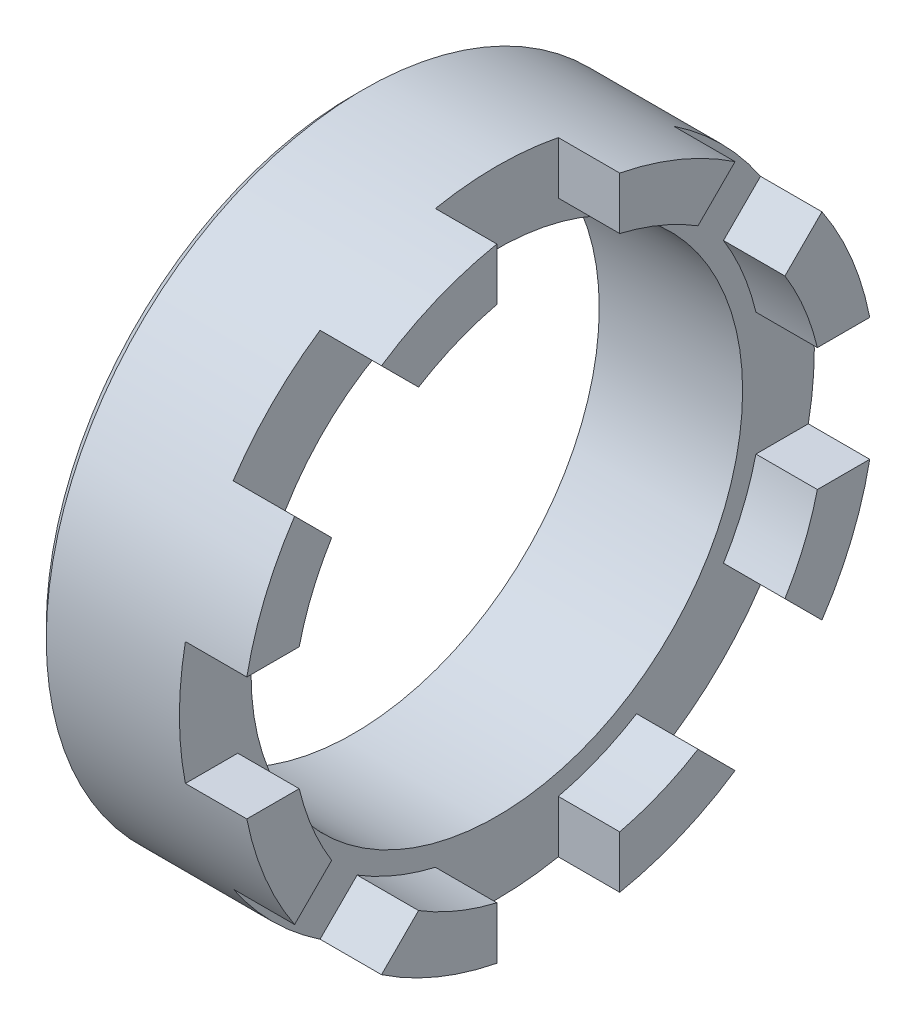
ISO-10303-21;
HEADER;
FILE_DESCRIPTION(('STEP AP214'),'2;1');
FILE_NAME('part.step','',(''),(''),'','','');
FILE_SCHEMA(('AUTOMOTIVE_DESIGN { 1 0 10303 214 1 1 1 1 }'));
ENDSEC;
DATA;
#1=APPLICATION_CONTEXT('core data for automotive mechanical design processes');
#2=APPLICATION_PROTOCOL_DEFINITION('international standard','automotive_design',2000,#1);
#3=PRODUCT_CONTEXT('',#1,'mechanical');
#4=PRODUCT('Part','Part','',(#3));
#5=PRODUCT_RELATED_PRODUCT_CATEGORY('part','',(#4));
#6=PRODUCT_DEFINITION_FORMATION('','',#4);
#7=PRODUCT_DEFINITION_CONTEXT('part definition',#1,'design');
#8=PRODUCT_DEFINITION('design','',#6,#7);
#9=PRODUCT_DEFINITION_SHAPE('','',#8);
#10=(LENGTH_UNIT() NAMED_UNIT(*) SI_UNIT(.MILLI.,.METRE.));
#11=(NAMED_UNIT(*) PLANE_ANGLE_UNIT() SI_UNIT($,.RADIAN.));
#12=(NAMED_UNIT(*) SI_UNIT($,.STERADIAN.) SOLID_ANGLE_UNIT());
#13=UNCERTAINTY_MEASURE_WITH_UNIT(LENGTH_MEASURE(1.E-05),#10,'distance_accuracy_value','');
#14=(GEOMETRIC_REPRESENTATION_CONTEXT(3) GLOBAL_UNCERTAINTY_ASSIGNED_CONTEXT((#13)) GLOBAL_UNIT_ASSIGNED_CONTEXT((#10,
#11,#12)) REPRESENTATION_CONTEXT('',''));
#15=CARTESIAN_POINT('',(0.,0.,0.));
#16=DIRECTION('',(0.,0.,1.));
#17=DIRECTION('',(1.,0.,0.));
#18=AXIS2_PLACEMENT_3D('',#15,#16,#17);
#19=CARTESIAN_POINT('',(-2.,0.,0.));
#20=DIRECTION('',(-1.,0.,0.));
#21=DIRECTION('',(0.,0.,1.));
#22=AXIS2_PLACEMENT_3D('',#19,#20,#21);
#23=CYLINDRICAL_SURFACE('',#22,15.5);
#24=CARTESIAN_POINT('',(0.499999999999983,0.,0.));
#25=DIRECTION('',(-1.,0.,0.));
#26=DIRECTION('',(0.,0.,1.));
#27=AXIS2_PLACEMENT_3D('',#24,#25,#26);
#28=CIRCLE('',#27,15.5);
#29=CARTESIAN_POINT('',(0.499999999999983,0.,15.5));
#30=VERTEX_POINT('',#29);
#31=EDGE_CURVE('E340',#30,#30,#28,.T.);
#32=ORIENTED_EDGE('',*,*,#31,.F.);
#33=EDGE_LOOP('',(#32));
#34=FACE_BOUND('',#33,.T.);
#35=CARTESIAN_POINT('',(7.00000000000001,0.,0.));
#36=DIRECTION('',(-1.,0.,0.));
#37=DIRECTION('',(0.,0.,1.));
#38=AXIS2_PLACEMENT_3D('',#35,#36,#37);
#39=CIRCLE('',#38,15.5);
#40=CARTESIAN_POINT('',(7.00000000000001,12.8742269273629,8.63158624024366));
#41=VERTEX_POINT('',#40);
#42=CARTESIAN_POINT('',(7.00000000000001,8.63158624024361,12.8742269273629));
#43=VERTEX_POINT('',#42);
#44=EDGE_CURVE('E272',#41,#43,#39,.F.);
#45=ORIENTED_EDGE('',*,*,#44,.F.);
#46=DIRECTION('',(-1.,0.,0.));
#47=VECTOR('',#46,1.);
#48=CARTESIAN_POINT('',(-2.,12.8742269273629,8.63158624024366));
#49=LINE('',#48,#47);
#50=CARTESIAN_POINT('',(10.,12.8742269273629,8.63158624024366));
#51=VERTEX_POINT('',#50);
#52=EDGE_CURVE('E276',#41,#51,#49,.F.);
#53=ORIENTED_EDGE('',*,*,#52,.T.);
#54=CARTESIAN_POINT('',(10.,0.,0.));
#55=DIRECTION('',(-1.,0.,0.));
#56=DIRECTION('',(0.,0.,1.));
#57=AXIS2_PLACEMENT_3D('',#54,#55,#56);
#58=CIRCLE('',#57,15.5);
#59=CARTESIAN_POINT('',(10.,15.2069063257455,3.));
#60=VERTEX_POINT('',#59);
#61=EDGE_CURVE('E445',#51,#60,#58,.T.);
#62=ORIENTED_EDGE('',*,*,#61,.T.);
#63=DIRECTION('',(-1.,0.,0.));
#64=VECTOR('',#63,1.);
#65=CARTESIAN_POINT('',(-2.,15.2069063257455,3.));
#66=LINE('',#65,#64);
#67=CARTESIAN_POINT('',(7.00000000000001,15.2069063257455,3.));
#68=VERTEX_POINT('',#67);
#69=EDGE_CURVE('E296',#68,#60,#66,.F.);
#70=ORIENTED_EDGE('',*,*,#69,.F.);
#71=CARTESIAN_POINT('',(7.00000000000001,0.,0.));
#72=DIRECTION('',(-1.,0.,0.));
#73=DIRECTION('',(0.,0.,1.));
#74=AXIS2_PLACEMENT_3D('',#71,#72,#73);
#75=CIRCLE('',#74,15.5);
#76=CARTESIAN_POINT('',(7.00000000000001,15.2069063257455,-3.));
#77=VERTEX_POINT('',#76);
#78=EDGE_CURVE('E315',#77,#68,#75,.F.);
#79=ORIENTED_EDGE('',*,*,#78,.F.);
#80=DIRECTION('',(-1.,0.,0.));
#81=VECTOR('',#80,1.);
#82=CARTESIAN_POINT('',(-2.,15.2069063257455,-3.));
#83=LINE('',#82,#81);
#84=CARTESIAN_POINT('',(10.,15.2069063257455,-3.));
#85=VERTEX_POINT('',#84);
#86=EDGE_CURVE('E312',#77,#85,#83,.F.);
#87=ORIENTED_EDGE('',*,*,#86,.T.);
#88=CARTESIAN_POINT('',(10.,12.874226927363,-8.63158624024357));
#89=VERTEX_POINT('',#88);
#90=EDGE_CURVE('E339',#85,#89,#58,.T.);
#91=ORIENTED_EDGE('',*,*,#90,.T.);
#92=DIRECTION('',(-1.,0.,0.));
#93=VECTOR('',#92,1.);
#94=CARTESIAN_POINT('',(-2.,12.874226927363,-8.63158624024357));
#95=LINE('',#94,#93);
#96=CARTESIAN_POINT('',(7.00000000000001,12.874226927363,-8.63158624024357));
#97=VERTEX_POINT('',#96);
#98=EDGE_CURVE('E267',#89,#97,#95,.T.);
#99=ORIENTED_EDGE('',*,*,#98,.T.);
#100=CARTESIAN_POINT('',(7.00000000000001,8.63158624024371,-12.8742269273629));
#101=VERTEX_POINT('',#100);
#102=EDGE_CURVE('E256',#101,#97,#39,.F.);
#103=ORIENTED_EDGE('',*,*,#102,.F.);
#104=DIRECTION('',(-1.,0.,0.));
#105=VECTOR('',#104,1.);
#106=CARTESIAN_POINT('',(-2.,8.6315862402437,-12.8742269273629));
#107=LINE('',#106,#105);
#108=CARTESIAN_POINT('',(10.,8.6315862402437,-12.8742269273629));
#109=VERTEX_POINT('',#108);
#110=EDGE_CURVE('E239',#109,#101,#107,.T.);
#111=ORIENTED_EDGE('',*,*,#110,.F.);
#112=CARTESIAN_POINT('',(10.,3.00000000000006,-15.2069063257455));
#113=VERTEX_POINT('',#112);
#114=EDGE_CURVE('E448',#109,#113,#58,.T.);
#115=ORIENTED_EDGE('',*,*,#114,.T.);
#116=DIRECTION('',(-1.,0.,0.));
#117=VECTOR('',#116,1.);
#118=CARTESIAN_POINT('',(-2.,3.00000000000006,-15.2069063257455));
#119=LINE('',#118,#117);
#120=CARTESIAN_POINT('',(7.00000000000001,3.00000000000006,-15.2069063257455));
#121=VERTEX_POINT('',#120);
#122=EDGE_CURVE('E442',#113,#121,#119,.T.);
#123=ORIENTED_EDGE('',*,*,#122,.T.);
#124=CARTESIAN_POINT('',(7.00000000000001,-2.99999999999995,-15.2069063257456));
#125=VERTEX_POINT('',#124);
#126=EDGE_CURVE('E268',#125,#121,#39,.F.);
#127=ORIENTED_EDGE('',*,*,#126,.F.);
#128=DIRECTION('',(-1.,0.,0.));
#129=VECTOR('',#128,1.);
#130=CARTESIAN_POINT('',(-2.,-2.99999999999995,-15.2069063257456));
#131=LINE('',#130,#129);
#132=CARTESIAN_POINT('',(10.,-2.99999999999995,-15.2069063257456));
#133=VERTEX_POINT('',#132);
#134=EDGE_CURVE('E553',#133,#125,#131,.T.);
#135=ORIENTED_EDGE('',*,*,#134,.F.);
#136=CARTESIAN_POINT('',(10.,-8.63158624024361,-12.8742269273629));
#137=VERTEX_POINT('',#136);
#138=EDGE_CURVE('E616',#133,#137,#58,.T.);
#139=ORIENTED_EDGE('',*,*,#138,.T.);
#140=DIRECTION('',(-1.,0.,0.));
#141=VECTOR('',#140,1.);
#142=CARTESIAN_POINT('',(-2.,-8.63158624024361,-12.8742269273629));
#143=LINE('',#142,#141);
#144=CARTESIAN_POINT('',(7.00000000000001,-8.63158624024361,-12.8742269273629));
#145=VERTEX_POINT('',#144);
#146=EDGE_CURVE('E514',#137,#145,#143,.T.);
#147=ORIENTED_EDGE('',*,*,#146,.T.);
#148=CARTESIAN_POINT('',(7.00000000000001,-12.8742269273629,-8.63158624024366));
#149=VERTEX_POINT('',#148);
#150=EDGE_CURVE('E271',#149,#145,#39,.F.);
#151=ORIENTED_EDGE('',*,*,#150,.F.);
#152=DIRECTION('',(-1.,0.,0.));
#153=VECTOR('',#152,1.);
#154=CARTESIAN_POINT('',(-2.,-12.8742269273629,-8.63158624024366));
#155=LINE('',#154,#153);
#156=CARTESIAN_POINT('',(10.,-12.8742269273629,-8.63158624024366));
#157=VERTEX_POINT('',#156);
#158=EDGE_CURVE('E522',#157,#149,#155,.T.);
#159=ORIENTED_EDGE('',*,*,#158,.F.);
#160=CARTESIAN_POINT('',(10.,-15.2069063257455,-3.));
#161=VERTEX_POINT('',#160);
#162=EDGE_CURVE('E337',#157,#161,#58,.T.);
#163=ORIENTED_EDGE('',*,*,#162,.T.);
#164=DIRECTION('',(-1.,0.,0.));
#165=VECTOR('',#164,1.);
#166=CARTESIAN_POINT('',(-2.,-15.2069063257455,-3.));
#167=LINE('',#166,#165);
#168=CARTESIAN_POINT('',(7.00000000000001,-15.2069063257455,-3.));
#169=VERTEX_POINT('',#168);
#170=EDGE_CURVE('E305',#161,#169,#167,.T.);
#171=ORIENTED_EDGE('',*,*,#170,.T.);
#172=CARTESIAN_POINT('',(7.00000000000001,-15.2069063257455,3.));
#173=VERTEX_POINT('',#172);
#174=EDGE_CURVE('E317',#173,#169,#75,.F.);
#175=ORIENTED_EDGE('',*,*,#174,.F.);
#176=DIRECTION('',(-1.,0.,0.));
#177=VECTOR('',#176,1.);
#178=CARTESIAN_POINT('',(-2.,-15.2069063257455,3.));
#179=LINE('',#178,#177);
#180=CARTESIAN_POINT('',(10.,-15.2069063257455,3.));
#181=VERTEX_POINT('',#180);
#182=EDGE_CURVE('E290',#181,#173,#179,.T.);
#183=ORIENTED_EDGE('',*,*,#182,.F.);
#184=CARTESIAN_POINT('',(10.,-12.874226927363,8.63158624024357));
#185=VERTEX_POINT('',#184);
#186=EDGE_CURVE('E334',#181,#185,#58,.T.);
#187=ORIENTED_EDGE('',*,*,#186,.T.);
#188=DIRECTION('',(-1.,0.,0.));
#189=VECTOR('',#188,1.);
#190=CARTESIAN_POINT('',(-2.,-12.874226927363,8.63158624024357));
#191=LINE('',#190,#189);
#192=CARTESIAN_POINT('',(7.00000000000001,-12.874226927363,8.63158624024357));
#193=VERTEX_POINT('',#192);
#194=EDGE_CURVE('E541',#193,#185,#191,.F.);
#195=ORIENTED_EDGE('',*,*,#194,.F.);
#196=CARTESIAN_POINT('',(7.00000000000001,-8.63158624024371,12.8742269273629));
#197=VERTEX_POINT('',#196);
#198=EDGE_CURVE('E269',#197,#193,#39,.F.);
#199=ORIENTED_EDGE('',*,*,#198,.F.);
#200=DIRECTION('',(-1.,0.,0.));
#201=VECTOR('',#200,1.);
#202=CARTESIAN_POINT('',(-2.,-8.6315862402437,12.8742269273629));
#203=LINE('',#202,#201);
#204=CARTESIAN_POINT('',(10.,-8.6315862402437,12.8742269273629));
#205=VERTEX_POINT('',#204);
#206=EDGE_CURVE('E528',#197,#205,#203,.F.);
#207=ORIENTED_EDGE('',*,*,#206,.T.);
#208=CARTESIAN_POINT('',(10.,-3.00000000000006,15.2069063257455));
#209=VERTEX_POINT('',#208);
#210=EDGE_CURVE('E338',#205,#209,#58,.T.);
#211=ORIENTED_EDGE('',*,*,#210,.T.);
#212=DIRECTION('',(-1.,0.,0.));
#213=VECTOR('',#212,1.);
#214=CARTESIAN_POINT('',(-2.,-3.00000000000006,15.2069063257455));
#215=LINE('',#214,#213);
#216=CARTESIAN_POINT('',(7.00000000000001,-3.00000000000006,15.2069063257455));
#217=VERTEX_POINT('',#216);
#218=EDGE_CURVE('E535',#217,#209,#215,.F.);
#219=ORIENTED_EDGE('',*,*,#218,.F.);
#220=CARTESIAN_POINT('',(7.00000000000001,2.99999999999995,15.2069063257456));
#221=VERTEX_POINT('',#220);
#222=EDGE_CURVE('E273',#221,#217,#39,.F.);
#223=ORIENTED_EDGE('',*,*,#222,.F.);
#224=DIRECTION('',(-1.,0.,0.));
#225=VECTOR('',#224,1.);
#226=CARTESIAN_POINT('',(-2.,2.99999999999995,15.2069063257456));
#227=LINE('',#226,#225);
#228=CARTESIAN_POINT('',(10.,2.99999999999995,15.2069063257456));
#229=VERTEX_POINT('',#228);
#230=EDGE_CURVE('E546',#221,#229,#227,.F.);
#231=ORIENTED_EDGE('',*,*,#230,.T.);
#232=CARTESIAN_POINT('',(10.,8.63158624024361,12.8742269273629));
#233=VERTEX_POINT('',#232);
#234=EDGE_CURVE('E447',#229,#233,#58,.T.);
#235=ORIENTED_EDGE('',*,*,#234,.T.);
#236=DIRECTION('',(-1.,0.,0.));
#237=VECTOR('',#236,1.);
#238=CARTESIAN_POINT('',(-2.,8.63158624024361,12.8742269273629));
#239=LINE('',#238,#237);
#240=EDGE_CURVE('E505',#43,#233,#239,.F.);
#241=ORIENTED_EDGE('',*,*,#240,.F.);
#242=EDGE_LOOP('',(#45,#53,#62,#70,#79,#87,#91,#99,#103,#111,#115,#123,#127,#135,#139,#147,#151,
#159,#163,#171,#175,#183,#187,#195,#199,#207,#211,#219,#223,#231,#235,#241));
#243=FACE_BOUND('',#242,.T.);
#244=ADVANCED_FACE('F31',(#34,#243),#23,.T.);
#245=CARTESIAN_POINT('',(10.,15.5,0.));
#246=DIRECTION('',(1.,0.,0.));
#247=DIRECTION('',(0.,0.,-1.));
#248=AXIS2_PLACEMENT_3D('',#245,#246,#247);
#249=PLANE('',#248);
#250=CARTESIAN_POINT('',(10.,0.,0.));
#251=DIRECTION('',(-1.,0.,0.));
#252=DIRECTION('',(0.,0.,1.));
#253=AXIS2_PLACEMENT_3D('',#250,#251,#252);
#254=CIRCLE('',#253,13.);
#255=CARTESIAN_POINT('',(10.,-2.99999999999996,-12.6491106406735));
#256=VERTEX_POINT('',#255);
#257=CARTESIAN_POINT('',(10.,-6.8229515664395,-11.0655922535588));
#258=VERTEX_POINT('',#257);
#259=EDGE_CURVE('E450',#256,#258,#254,.T.);
#260=ORIENTED_EDGE('',*,*,#259,.T.);
#261=DIRECTION('',(0.,-0.707106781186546,-0.707106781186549));
#262=VECTOR('',#261,1.);
#263=CARTESIAN_POINT('',(10.,9.87132034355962,5.62867965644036));
#264=LINE('',#263,#262);
#265=EDGE_CURVE('E517',#258,#137,#264,.T.);
#266=ORIENTED_EDGE('',*,*,#265,.T.);
#267=ORIENTED_EDGE('',*,*,#138,.F.);
#268=DIRECTION('',(0.,0.,-1.));
#269=VECTOR('',#268,1.);
#270=CARTESIAN_POINT('',(10.,-3.00000000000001,0.));
#271=LINE('',#270,#269);
#272=EDGE_CURVE('E555',#256,#133,#271,.T.);
#273=ORIENTED_EDGE('',*,*,#272,.F.);
#274=EDGE_LOOP('',(#260,#266,#267,#273));
#275=FACE_BOUND('',#274,.T.);
#276=ADVANCED_FACE('F360',(#275),#249,.T.);
#277=CARTESIAN_POINT('',(10.,12.6491106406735,-3.));
#278=VERTEX_POINT('',#277);
#279=CARTESIAN_POINT('',(10.,11.0655922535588,-6.82295156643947));
#280=VERTEX_POINT('',#279);
#281=EDGE_CURVE('E333',#278,#280,#254,.T.);
#282=ORIENTED_EDGE('',*,*,#281,.T.);
#283=DIRECTION('',(0.,0.707106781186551,-0.707106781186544));
#284=VECTOR('',#283,1.);
#285=CARTESIAN_POINT('',(10.,9.87132034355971,-5.62867965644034));
#286=LINE('',#285,#284);
#287=EDGE_CURVE('E430',#280,#89,#286,.T.);
#288=ORIENTED_EDGE('',*,*,#287,.T.);
#289=ORIENTED_EDGE('',*,*,#90,.F.);
#290=DIRECTION('',(0.,-1.,0.));
#291=VECTOR('',#290,1.);
#292=CARTESIAN_POINT('',(10.,15.5,-3.));
#293=LINE('',#292,#291);
#294=EDGE_CURVE('E306',#85,#278,#293,.T.);
#295=ORIENTED_EDGE('',*,*,#294,.T.);
#296=EDGE_LOOP('',(#282,#288,#289,#295));
#297=FACE_BOUND('',#296,.T.);
#298=ADVANCED_FACE('F368',(#297),#249,.T.);
#299=CARTESIAN_POINT('',(10.,6.82295156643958,-11.0655922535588));
#300=VERTEX_POINT('',#299);
#301=CARTESIAN_POINT('',(10.,3.00000000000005,-12.6491106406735));
#302=VERTEX_POINT('',#301);
#303=EDGE_CURVE('E446',#300,#302,#254,.T.);
#304=ORIENTED_EDGE('',*,*,#303,.T.);
#305=DIRECTION('',(0.,0.,-1.));
#306=VECTOR('',#305,1.);
#307=CARTESIAN_POINT('',(10.,3.,0.));
#308=LINE('',#307,#306);
#309=EDGE_CURVE('E46',#302,#113,#308,.T.);
#310=ORIENTED_EDGE('',*,*,#309,.T.);
#311=ORIENTED_EDGE('',*,*,#114,.F.);
#312=DIRECTION('',(0.,0.707106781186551,-0.707106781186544));
#313=VECTOR('',#312,1.);
#314=CARTESIAN_POINT('',(10.,5.62867965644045,-9.87132034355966));
#315=LINE('',#314,#313);
#316=EDGE_CURVE('E245',#300,#109,#315,.T.);
#317=ORIENTED_EDGE('',*,*,#316,.F.);
#318=EDGE_LOOP('',(#304,#310,#311,#317));
#319=FACE_BOUND('',#318,.T.);
#320=ADVANCED_FACE('F646',(#319),#249,.T.);
#321=CARTESIAN_POINT('',(-2.,0.,0.));
#322=DIRECTION('',(-1.,0.,0.));
#323=DIRECTION('',(0.,0.,1.));
#324=AXIS2_PLACEMENT_3D('',#321,#322,#323);
#325=CYLINDRICAL_SURFACE('',#324,13.);
#326=CARTESIAN_POINT('',(7.00000000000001,0.,0.));
#327=DIRECTION('',(-1.,0.,0.));
#328=DIRECTION('',(0.,0.,1.));
#329=AXIS2_PLACEMENT_3D('',#326,#327,#328);
#330=CIRCLE('',#329,13.);
#331=CARTESIAN_POINT('',(7.00000000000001,-2.99999999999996,-12.6491106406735));
#332=VERTEX_POINT('',#331);
#333=CARTESIAN_POINT('',(7.00000000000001,-6.82295156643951,-11.0655922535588));
#334=VERTEX_POINT('',#333);
#335=EDGE_CURVE('E468',#332,#334,#330,.T.);
#336=ORIENTED_EDGE('',*,*,#335,.T.);
#337=DIRECTION('',(-1.,0.,0.));
#338=VECTOR('',#337,1.);
#339=CARTESIAN_POINT('',(-2.,-6.8229515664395,-11.0655922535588));
#340=LINE('',#339,#338);
#341=EDGE_CURVE('E520',#334,#258,#340,.F.);
#342=ORIENTED_EDGE('',*,*,#341,.T.);
#343=ORIENTED_EDGE('',*,*,#259,.F.);
#344=DIRECTION('',(-1.,0.,0.));
#345=VECTOR('',#344,1.);
#346=CARTESIAN_POINT('',(-2.,-2.99999999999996,-12.6491106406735));
#347=LINE('',#346,#345);
#348=EDGE_CURVE('E557',#332,#256,#347,.F.);
#349=ORIENTED_EDGE('',*,*,#348,.F.);
#350=EDGE_LOOP('',(#336,#342,#343,#349));
#351=FACE_BOUND('',#350,.T.);
#352=ADVANCED_FACE('F375',(#351),#325,.F.);
#353=CARTESIAN_POINT('',(7.00000000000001,12.6491106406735,-3.));
#354=VERTEX_POINT('',#353);
#355=CARTESIAN_POINT('',(7.00000000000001,11.0655922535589,-6.82295156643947));
#356=VERTEX_POINT('',#355);
#357=EDGE_CURVE('E327',#354,#356,#330,.T.);
#358=ORIENTED_EDGE('',*,*,#357,.T.);
#359=DIRECTION('',(-1.,0.,0.));
#360=VECTOR('',#359,1.);
#361=CARTESIAN_POINT('',(-2.,11.0655922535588,-6.82295156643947));
#362=LINE('',#361,#360);
#363=EDGE_CURVE('E432',#356,#280,#362,.F.);
#364=ORIENTED_EDGE('',*,*,#363,.T.);
#365=ORIENTED_EDGE('',*,*,#281,.F.);
#366=DIRECTION('',(-1.,0.,0.));
#367=VECTOR('',#366,1.);
#368=CARTESIAN_POINT('',(-2.,12.6491106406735,-3.));
#369=LINE('',#368,#367);
#370=EDGE_CURVE('E309',#278,#354,#369,.T.);
#371=ORIENTED_EDGE('',*,*,#370,.T.);
#372=EDGE_LOOP('',(#358,#364,#365,#371));
#373=FACE_BOUND('',#372,.T.);
#374=ADVANCED_FACE('F440',(#373),#325,.F.);
#375=CARTESIAN_POINT('',(7.00000000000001,6.82295156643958,-11.0655922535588));
#376=VERTEX_POINT('',#375);
#377=CARTESIAN_POINT('',(7.00000000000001,3.00000000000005,-12.6491106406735));
#378=VERTEX_POINT('',#377);
#379=EDGE_CURVE('E260',#376,#378,#330,.T.);
#380=ORIENTED_EDGE('',*,*,#379,.T.);
#381=DIRECTION('',(-1.,0.,0.));
#382=VECTOR('',#381,1.);
#383=CARTESIAN_POINT('',(-2.,3.00000000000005,-12.6491106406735));
#384=LINE('',#383,#382);
#385=EDGE_CURVE('E250',#378,#302,#384,.F.);
#386=ORIENTED_EDGE('',*,*,#385,.T.);
#387=ORIENTED_EDGE('',*,*,#303,.F.);
#388=DIRECTION('',(-1.,0.,0.));
#389=VECTOR('',#388,1.);
#390=CARTESIAN_POINT('',(-2.,6.82295156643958,-11.0655922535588));
#391=LINE('',#390,#389);
#392=EDGE_CURVE('E565',#376,#300,#391,.F.);
#393=ORIENTED_EDGE('',*,*,#392,.F.);
#394=EDGE_LOOP('',(#380,#386,#387,#393));
#395=FACE_BOUND('',#394,.T.);
#396=ADVANCED_FACE('F637',(#395),#325,.F.);
#397=ORIENTED_EDGE('',*,*,#61,.F.);
#398=DIRECTION('',(0.,-0.707106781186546,-0.707106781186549));
#399=VECTOR('',#398,1.);
#400=CARTESIAN_POINT('',(10.,9.87132034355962,5.62867965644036));
#401=LINE('',#400,#399);
#402=CARTESIAN_POINT('',(10.,11.0655922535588,6.82295156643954));
#403=VERTEX_POINT('',#402);
#404=EDGE_CURVE('E504',#51,#403,#401,.T.);
#405=ORIENTED_EDGE('',*,*,#404,.T.);
#406=CARTESIAN_POINT('',(10.,12.6491106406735,3.));
#407=VERTEX_POINT('',#406);
#408=EDGE_CURVE('E451',#403,#407,#254,.T.);
#409=ORIENTED_EDGE('',*,*,#408,.T.);
#410=DIRECTION('',(0.,-1.,0.));
#411=VECTOR('',#410,1.);
#412=CARTESIAN_POINT('',(10.,15.5,3.));
#413=LINE('',#412,#411);
#414=EDGE_CURVE('E291',#60,#407,#413,.T.);
#415=ORIENTED_EDGE('',*,*,#414,.F.);
#416=EDGE_LOOP('',(#397,#405,#409,#415));
#417=FACE_BOUND('',#416,.T.);
#418=ADVANCED_FACE('F503',(#417),#249,.T.);
#419=ORIENTED_EDGE('',*,*,#210,.F.);
#420=DIRECTION('',(0.,0.707106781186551,-0.707106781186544));
#421=VECTOR('',#420,1.);
#422=CARTESIAN_POINT('',(10.,9.87132034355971,-5.62867965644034));
#423=LINE('',#422,#421);
#424=CARTESIAN_POINT('',(10.,-6.82295156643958,11.0655922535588));
#425=VERTEX_POINT('',#424);
#426=EDGE_CURVE('E531',#205,#425,#423,.T.);
#427=ORIENTED_EDGE('',*,*,#426,.T.);
#428=CARTESIAN_POINT('',(10.,-3.00000000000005,12.6491106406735));
#429=VERTEX_POINT('',#428);
#430=EDGE_CURVE('E332',#425,#429,#254,.T.);
#431=ORIENTED_EDGE('',*,*,#430,.T.);
#432=DIRECTION('',(0.,0.,-1.));
#433=VECTOR('',#432,1.);
#434=CARTESIAN_POINT('',(10.,-3.00000000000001,0.));
#435=LINE('',#434,#433);
#436=EDGE_CURVE('E537',#209,#429,#435,.T.);
#437=ORIENTED_EDGE('',*,*,#436,.F.);
#438=EDGE_LOOP('',(#419,#427,#431,#437));
#439=FACE_BOUND('',#438,.T.);
#440=ADVANCED_FACE('F630',(#439),#249,.T.);
#441=DIRECTION('',(0.,-0.707106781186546,-0.707106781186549));
#442=VECTOR('',#441,1.);
#443=CARTESIAN_POINT('',(10.,5.62867965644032,9.87132034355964));
#444=LINE('',#443,#442);
#445=CARTESIAN_POINT('',(10.,6.8229515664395,11.0655922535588));
#446=VERTEX_POINT('',#445);
#447=EDGE_CURVE('E509',#233,#446,#444,.T.);
#448=ORIENTED_EDGE('',*,*,#447,.F.);
#449=ORIENTED_EDGE('',*,*,#234,.F.);
#450=DIRECTION('',(0.,0.,-1.));
#451=VECTOR('',#450,1.);
#452=CARTESIAN_POINT('',(10.,3.,0.));
#453=LINE('',#452,#451);
#454=CARTESIAN_POINT('',(10.,2.99999999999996,12.6491106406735));
#455=VERTEX_POINT('',#454);
#456=EDGE_CURVE('E549',#229,#455,#453,.T.);
#457=ORIENTED_EDGE('',*,*,#456,.T.);
#458=EDGE_CURVE('E453',#455,#446,#254,.T.);
#459=ORIENTED_EDGE('',*,*,#458,.T.);
#460=EDGE_LOOP('',(#448,#449,#457,#459));
#461=FACE_BOUND('',#460,.T.);
#462=ADVANCED_FACE('F625',(#461),#249,.T.);
#463=ORIENTED_EDGE('',*,*,#408,.F.);
#464=DIRECTION('',(-1.,0.,0.));
#465=VECTOR('',#464,1.);
#466=CARTESIAN_POINT('',(-2.,11.0655922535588,6.82295156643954));
#467=LINE('',#466,#465);
#468=CARTESIAN_POINT('',(7.00000000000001,11.0655922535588,6.82295156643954));
#469=VERTEX_POINT('',#468);
#470=EDGE_CURVE('E495',#403,#469,#467,.T.);
#471=ORIENTED_EDGE('',*,*,#470,.T.);
#472=CARTESIAN_POINT('',(7.00000000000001,12.6491106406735,3.));
#473=VERTEX_POINT('',#472);
#474=EDGE_CURVE('E321',#469,#473,#330,.T.);
#475=ORIENTED_EDGE('',*,*,#474,.T.);
#476=DIRECTION('',(-1.,0.,0.));
#477=VECTOR('',#476,1.);
#478=CARTESIAN_POINT('',(-2.,12.6491106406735,3.));
#479=LINE('',#478,#477);
#480=EDGE_CURVE('E293',#407,#473,#479,.T.);
#481=ORIENTED_EDGE('',*,*,#480,.F.);
#482=EDGE_LOOP('',(#463,#471,#475,#481));
#483=FACE_BOUND('',#482,.T.);
#484=ADVANCED_FACE('F494',(#483),#325,.F.);
#485=ORIENTED_EDGE('',*,*,#430,.F.);
#486=DIRECTION('',(-1.,0.,0.));
#487=VECTOR('',#486,1.);
#488=CARTESIAN_POINT('',(-2.,-6.82295156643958,11.0655922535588));
#489=LINE('',#488,#487);
#490=CARTESIAN_POINT('',(7.00000000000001,-6.82295156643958,11.0655922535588));
#491=VERTEX_POINT('',#490);
#492=EDGE_CURVE('E533',#425,#491,#489,.T.);
#493=ORIENTED_EDGE('',*,*,#492,.T.);
#494=CARTESIAN_POINT('',(7.00000000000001,-3.00000000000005,12.6491106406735));
#495=VERTEX_POINT('',#494);
#496=EDGE_CURVE('E326',#491,#495,#330,.T.);
#497=ORIENTED_EDGE('',*,*,#496,.T.);
#498=DIRECTION('',(-1.,0.,0.));
#499=VECTOR('',#498,1.);
#500=CARTESIAN_POINT('',(-2.,-3.00000000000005,12.6491106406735));
#501=LINE('',#500,#499);
#502=EDGE_CURVE('E539',#429,#495,#501,.T.);
#503=ORIENTED_EDGE('',*,*,#502,.F.);
#504=EDGE_LOOP('',(#485,#493,#497,#503));
#505=FACE_BOUND('',#504,.T.);
#506=ADVANCED_FACE('F631',(#505),#325,.F.);
#507=DIRECTION('',(-1.,0.,0.));
#508=VECTOR('',#507,1.);
#509=CARTESIAN_POINT('',(-2.,6.8229515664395,11.0655922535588));
#510=LINE('',#509,#508);
#511=CARTESIAN_POINT('',(7.00000000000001,6.8229515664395,11.0655922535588));
#512=VERTEX_POINT('',#511);
#513=EDGE_CURVE('E511',#446,#512,#510,.T.);
#514=ORIENTED_EDGE('',*,*,#513,.F.);
#515=ORIENTED_EDGE('',*,*,#458,.F.);
#516=DIRECTION('',(-1.,0.,0.));
#517=VECTOR('',#516,1.);
#518=CARTESIAN_POINT('',(-2.,2.99999999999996,12.6491106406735));
#519=LINE('',#518,#517);
#520=CARTESIAN_POINT('',(7.00000000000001,2.99999999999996,12.6491106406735));
#521=VERTEX_POINT('',#520);
#522=EDGE_CURVE('E551',#455,#521,#519,.T.);
#523=ORIENTED_EDGE('',*,*,#522,.T.);
#524=EDGE_CURVE('E480',#521,#512,#330,.T.);
#525=ORIENTED_EDGE('',*,*,#524,.T.);
#526=EDGE_LOOP('',(#514,#515,#523,#525));
#527=FACE_BOUND('',#526,.T.);
#528=ADVANCED_FACE('F627',(#527),#325,.F.);
#529=DIRECTION('',(0.,-0.707106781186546,-0.707106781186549));
#530=VECTOR('',#529,1.);
#531=CARTESIAN_POINT('',(10.,5.62867965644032,9.87132034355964));
#532=LINE('',#531,#530);
#533=CARTESIAN_POINT('',(10.,-11.0655922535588,-6.82295156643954));
#534=VERTEX_POINT('',#533);
#535=EDGE_CURVE('E524',#534,#157,#532,.T.);
#536=ORIENTED_EDGE('',*,*,#535,.F.);
#537=CARTESIAN_POINT('',(10.,-12.6491106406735,-3.));
#538=VERTEX_POINT('',#537);
#539=EDGE_CURVE('E331',#534,#538,#254,.T.);
#540=ORIENTED_EDGE('',*,*,#539,.T.);
#541=EDGE_CURVE('E302',#538,#161,#293,.T.);
#542=ORIENTED_EDGE('',*,*,#541,.T.);
#543=ORIENTED_EDGE('',*,*,#162,.F.);
#544=EDGE_LOOP('',(#536,#540,#542,#543));
#545=FACE_BOUND('',#544,.T.);
#546=ADVANCED_FACE('F361',(#545),#249,.T.);
#547=DIRECTION('',(-1.,0.,0.));
#548=VECTOR('',#547,1.);
#549=CARTESIAN_POINT('',(-2.,-11.0655922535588,-6.82295156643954));
#550=LINE('',#549,#548);
#551=CARTESIAN_POINT('',(7.00000000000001,-11.0655922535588,-6.82295156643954));
#552=VERTEX_POINT('',#551);
#553=EDGE_CURVE('E526',#552,#534,#550,.F.);
#554=ORIENTED_EDGE('',*,*,#553,.F.);
#555=CARTESIAN_POINT('',(7.00000000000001,-12.6491106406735,-3.));
#556=VERTEX_POINT('',#555);
#557=EDGE_CURVE('E325',#552,#556,#330,.T.);
#558=ORIENTED_EDGE('',*,*,#557,.T.);
#559=DIRECTION('',(-1.,0.,0.));
#560=VECTOR('',#559,1.);
#561=CARTESIAN_POINT('',(-2.,-12.6491106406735,-3.));
#562=LINE('',#561,#560);
#563=EDGE_CURVE('E299',#556,#538,#562,.F.);
#564=ORIENTED_EDGE('',*,*,#563,.T.);
#565=ORIENTED_EDGE('',*,*,#539,.F.);
#566=EDGE_LOOP('',(#554,#558,#564,#565));
#567=FACE_BOUND('',#566,.T.);
#568=ADVANCED_FACE('F376',(#567),#325,.F.);
#569=CARTESIAN_POINT('',(-2.,0.,0.));
#570=DIRECTION('',(-1.,0.,0.));
#571=DIRECTION('',(0.,0.,1.));
#572=AXIS2_PLACEMENT_3D('',#569,#570,#571);
#573=CYLINDRICAL_SURFACE('',#572,12.);
#574=CARTESIAN_POINT('',(0.,0.,0.));
#575=DIRECTION('',(-1.,0.,0.));
#576=DIRECTION('',(0.,0.,1.));
#577=AXIS2_PLACEMENT_3D('',#574,#575,#576);
#578=CIRCLE('',#577,12.);
#579=CARTESIAN_POINT('',(0.,0.,12.));
#580=VERTEX_POINT('',#579);
#581=EDGE_CURVE('E11',#580,#580,#578,.T.);
#582=ORIENTED_EDGE('',*,*,#581,.T.);
#583=EDGE_LOOP('',(#582));
#584=FACE_BOUND('',#583,.T.);
#585=CARTESIAN_POINT('',(7.00000000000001,0.,0.));
#586=DIRECTION('',(-1.,0.,0.));
#587=DIRECTION('',(0.,0.,1.));
#588=AXIS2_PLACEMENT_3D('',#585,#586,#587);
#589=CIRCLE('',#588,12.);
#590=CARTESIAN_POINT('',(7.00000000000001,0.,12.));
#591=VERTEX_POINT('',#590);
#592=EDGE_CURVE('E318',#591,#591,#589,.T.);
#593=ORIENTED_EDGE('',*,*,#592,.F.);
#594=EDGE_LOOP('',(#593));
#595=FACE_BOUND('',#594,.T.);
#596=ADVANCED_FACE('F33',(#584,#595),#573,.F.);
#597=CARTESIAN_POINT('',(0.,12.,0.));
#598=DIRECTION('',(-1.,0.,0.));
#599=DIRECTION('',(0.,0.,1.));
#600=AXIS2_PLACEMENT_3D('',#597,#598,#599);
#601=PLANE('',#600);
#602=CARTESIAN_POINT('',(0.,0.,0.));
#603=DIRECTION('',(-1.,0.,0.));
#604=DIRECTION('',(0.,0.,1.));
#605=AXIS2_PLACEMENT_3D('',#602,#603,#604);
#606=CIRCLE('',#605,15.);
#607=CARTESIAN_POINT('',(0.,0.,15.));
#608=VERTEX_POINT('',#607);
#609=EDGE_CURVE('E39',#608,#608,#606,.T.);
#610=ORIENTED_EDGE('',*,*,#609,.T.);
#611=EDGE_LOOP('',(#610));
#612=FACE_BOUND('',#611,.T.);
#613=ORIENTED_EDGE('',*,*,#581,.F.);
#614=EDGE_LOOP('',(#613));
#615=FACE_BOUND('',#614,.T.);
#616=ADVANCED_FACE('F345',(#612,#615),#601,.T.);
#617=CARTESIAN_POINT('',(0.,0.,0.));
#618=DIRECTION('',(1.,0.,0.));
#619=DIRECTION('',(0.,0.,-1.));
#620=AXIS2_PLACEMENT_3D('',#617,#618,#619);
#621=CONICAL_SURFACE('',#620,15.,0.785398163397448);
#622=ORIENTED_EDGE('',*,*,#31,.T.);
#623=EDGE_LOOP('',(#622));
#624=FACE_BOUND('',#623,.T.);
#625=ORIENTED_EDGE('',*,*,#609,.F.);
#626=EDGE_LOOP('',(#625));
#627=FACE_BOUND('',#626,.T.);
#628=ADVANCED_FACE('F348',(#624,#627),#621,.T.);
#629=DIRECTION('',(0.,0.707106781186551,-0.707106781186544));
#630=VECTOR('',#629,1.);
#631=CARTESIAN_POINT('',(10.,5.62867965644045,-9.87132034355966));
#632=LINE('',#631,#630);
#633=CARTESIAN_POINT('',(10.,-11.0655922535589,6.82295156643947));
#634=VERTEX_POINT('',#633);
#635=EDGE_CURVE('E54',#185,#634,#632,.T.);
#636=ORIENTED_EDGE('',*,*,#635,.F.);
#637=ORIENTED_EDGE('',*,*,#186,.F.);
#638=CARTESIAN_POINT('',(10.,-12.6491106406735,3.));
#639=VERTEX_POINT('',#638);
#640=EDGE_CURVE('E288',#639,#181,#413,.T.);
#641=ORIENTED_EDGE('',*,*,#640,.F.);
#642=EDGE_CURVE('E328',#639,#634,#254,.T.);
#643=ORIENTED_EDGE('',*,*,#642,.T.);
#644=EDGE_LOOP('',(#636,#637,#641,#643));
#645=FACE_BOUND('',#644,.T.);
#646=ADVANCED_FACE('F350',(#645),#249,.T.);
#647=DIRECTION('',(-1.,0.,0.));
#648=VECTOR('',#647,1.);
#649=CARTESIAN_POINT('',(-2.,-11.0655922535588,6.82295156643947));
#650=LINE('',#649,#648);
#651=CARTESIAN_POINT('',(7.00000000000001,-11.0655922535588,6.82295156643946));
#652=VERTEX_POINT('',#651);
#653=EDGE_CURVE('E544',#634,#652,#650,.T.);
#654=ORIENTED_EDGE('',*,*,#653,.F.);
#655=ORIENTED_EDGE('',*,*,#642,.F.);
#656=DIRECTION('',(-1.,0.,0.));
#657=VECTOR('',#656,1.);
#658=CARTESIAN_POINT('',(-2.,-12.6491106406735,3.));
#659=LINE('',#658,#657);
#660=CARTESIAN_POINT('',(7.00000000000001,-12.6491106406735,3.));
#661=VERTEX_POINT('',#660);
#662=EDGE_CURVE('E286',#661,#639,#659,.F.);
#663=ORIENTED_EDGE('',*,*,#662,.F.);
#664=EDGE_CURVE('E322',#661,#652,#330,.T.);
#665=ORIENTED_EDGE('',*,*,#664,.T.);
#666=EDGE_LOOP('',(#654,#655,#663,#665));
#667=FACE_BOUND('',#666,.T.);
#668=ADVANCED_FACE('F357',(#667),#325,.F.);
#669=CARTESIAN_POINT('',(7.00000000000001,13.,0.));
#670=DIRECTION('',(1.,0.,0.));
#671=DIRECTION('',(0.,0.,-1.));
#672=AXIS2_PLACEMENT_3D('',#669,#670,#671);
#673=PLANE('',#672);
#674=ORIENTED_EDGE('',*,*,#592,.T.);
#675=EDGE_LOOP('',(#674));
#676=FACE_BOUND('',#675,.T.);
#677=ORIENTED_EDGE('',*,*,#379,.F.);
#678=DIRECTION('',(0.,-0.707106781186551,0.707106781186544));
#679=VECTOR('',#678,1.);
#680=CARTESIAN_POINT('',(7.00000000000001,13.3786796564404,-17.6213203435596));
#681=LINE('',#680,#679);
#682=EDGE_CURVE('E242',#101,#376,#681,.T.);
#683=ORIENTED_EDGE('',*,*,#682,.F.);
#684=ORIENTED_EDGE('',*,*,#102,.T.);
#685=DIRECTION('',(0.,-0.707106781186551,0.707106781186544));
#686=VECTOR('',#685,1.);
#687=CARTESIAN_POINT('',(7.00000000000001,17.6213203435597,-13.3786796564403));
#688=LINE('',#687,#686);
#689=EDGE_CURVE('E582',#97,#356,#688,.T.);
#690=ORIENTED_EDGE('',*,*,#689,.T.);
#691=ORIENTED_EDGE('',*,*,#357,.F.);
#692=DIRECTION('',(0.,1.,0.));
#693=VECTOR('',#692,1.);
#694=CARTESIAN_POINT('',(7.00000000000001,-15.5,-3.));
#695=LINE('',#694,#693);
#696=EDGE_CURVE('E282',#354,#77,#695,.T.);
#697=ORIENTED_EDGE('',*,*,#696,.T.);
#698=ORIENTED_EDGE('',*,*,#78,.T.);
#699=DIRECTION('',(0.,1.,0.));
#700=VECTOR('',#699,1.);
#701=CARTESIAN_POINT('',(7.00000000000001,-15.5,3.));
#702=LINE('',#701,#700);
#703=EDGE_CURVE('E278',#473,#68,#702,.T.);
#704=ORIENTED_EDGE('',*,*,#703,.F.);
#705=ORIENTED_EDGE('',*,*,#474,.F.);
#706=DIRECTION('',(0.,0.707106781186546,0.707106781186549));
#707=VECTOR('',#706,1.);
#708=CARTESIAN_POINT('',(7.00000000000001,-13.3786796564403,-17.6213203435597));
#709=LINE('',#708,#707);
#710=EDGE_CURVE('E568',#469,#41,#709,.T.);
#711=ORIENTED_EDGE('',*,*,#710,.T.);
#712=ORIENTED_EDGE('',*,*,#44,.T.);
#713=DIRECTION('',(0.,0.707106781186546,0.707106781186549));
#714=VECTOR('',#713,1.);
#715=CARTESIAN_POINT('',(7.00000000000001,-17.6213203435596,-13.3786796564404));
#716=LINE('',#715,#714);
#717=EDGE_CURVE('E571',#512,#43,#716,.T.);
#718=ORIENTED_EDGE('',*,*,#717,.F.);
#719=ORIENTED_EDGE('',*,*,#524,.F.);
#720=DIRECTION('',(0.,0.,1.));
#721=VECTOR('',#720,1.);
#722=CARTESIAN_POINT('',(7.00000000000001,3.00000000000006,-15.5));
#723=LINE('',#722,#721);
#724=EDGE_CURVE('E575',#521,#221,#723,.T.);
#725=ORIENTED_EDGE('',*,*,#724,.T.);
#726=ORIENTED_EDGE('',*,*,#222,.T.);
#727=DIRECTION('',(0.,0.,1.));
#728=VECTOR('',#727,1.);
#729=CARTESIAN_POINT('',(7.00000000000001,-2.99999999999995,-15.5000000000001));
#730=LINE('',#729,#728);
#731=EDGE_CURVE('E579',#495,#217,#730,.T.);
#732=ORIENTED_EDGE('',*,*,#731,.F.);
#733=ORIENTED_EDGE('',*,*,#496,.F.);
#734=EDGE_CURVE('E261',#491,#197,#688,.T.);
#735=ORIENTED_EDGE('',*,*,#734,.T.);
#736=ORIENTED_EDGE('',*,*,#198,.T.);
#737=EDGE_CURVE('E262',#652,#193,#681,.T.);
#738=ORIENTED_EDGE('',*,*,#737,.F.);
#739=ORIENTED_EDGE('',*,*,#664,.F.);
#740=EDGE_CURVE('E281',#173,#661,#702,.T.);
#741=ORIENTED_EDGE('',*,*,#740,.F.);
#742=ORIENTED_EDGE('',*,*,#174,.T.);
#743=EDGE_CURVE('E285',#169,#556,#695,.T.);
#744=ORIENTED_EDGE('',*,*,#743,.T.);
#745=ORIENTED_EDGE('',*,*,#557,.F.);
#746=EDGE_CURVE('E570',#149,#552,#716,.T.);
#747=ORIENTED_EDGE('',*,*,#746,.F.);
#748=ORIENTED_EDGE('',*,*,#150,.T.);
#749=EDGE_CURVE('E567',#145,#334,#709,.T.);
#750=ORIENTED_EDGE('',*,*,#749,.T.);
#751=ORIENTED_EDGE('',*,*,#335,.F.);
#752=EDGE_CURVE('E578',#125,#332,#730,.T.);
#753=ORIENTED_EDGE('',*,*,#752,.F.);
#754=ORIENTED_EDGE('',*,*,#126,.T.);
#755=EDGE_CURVE('E574',#121,#378,#723,.T.);
#756=ORIENTED_EDGE('',*,*,#755,.T.);
#757=EDGE_LOOP('',(#677,#683,#684,#690,#691,#697,#698,#704,#705,#711,#712,#718,#719,#725,#726,
#732,#733,#735,#736,#738,#739,#741,#742,#744,#745,#747,#748,#750,#751,#753,#754,#756));
#758=FACE_BOUND('',#757,.T.);
#759=ADVANCED_FACE('F254',(#676,#758),#673,.T.);
#760=CARTESIAN_POINT('',(7.00000000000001,-15.5,-3.));
#761=DIRECTION('',(0.,0.,1.));
#762=DIRECTION('',(1.,0.,0.));
#763=AXIS2_PLACEMENT_3D('',#760,#761,#762);
#764=PLANE('',#763);
#765=ORIENTED_EDGE('',*,*,#541,.F.);
#766=ORIENTED_EDGE('',*,*,#563,.F.);
#767=ORIENTED_EDGE('',*,*,#743,.F.);
#768=ORIENTED_EDGE('',*,*,#170,.F.);
#769=EDGE_LOOP('',(#765,#766,#767,#768));
#770=FACE_BOUND('',#769,.T.);
#771=ADVANCED_FACE('F379',(#770),#764,.T.);
#772=CARTESIAN_POINT('',(7.00000000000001,-15.5,3.));
#773=DIRECTION('',(0.,0.,1.));
#774=DIRECTION('',(1.,0.,0.));
#775=AXIS2_PLACEMENT_3D('',#772,#773,#774);
#776=PLANE('',#775);
#777=ORIENTED_EDGE('',*,*,#182,.T.);
#778=ORIENTED_EDGE('',*,*,#740,.T.);
#779=ORIENTED_EDGE('',*,*,#662,.T.);
#780=ORIENTED_EDGE('',*,*,#640,.T.);
#781=EDGE_LOOP('',(#777,#778,#779,#780));
#782=FACE_BOUND('',#781,.T.);
#783=ADVANCED_FACE('F383',(#782),#776,.F.);
#784=ORIENTED_EDGE('',*,*,#696,.F.);
#785=ORIENTED_EDGE('',*,*,#370,.F.);
#786=ORIENTED_EDGE('',*,*,#294,.F.);
#787=ORIENTED_EDGE('',*,*,#86,.F.);
#788=EDGE_LOOP('',(#784,#785,#786,#787));
#789=FACE_BOUND('',#788,.T.);
#790=ADVANCED_FACE('F385',(#789),#764,.T.);
#791=ORIENTED_EDGE('',*,*,#69,.T.);
#792=ORIENTED_EDGE('',*,*,#414,.T.);
#793=ORIENTED_EDGE('',*,*,#480,.T.);
#794=ORIENTED_EDGE('',*,*,#703,.T.);
#795=EDGE_LOOP('',(#791,#792,#793,#794));
#796=FACE_BOUND('',#795,.T.);
#797=ADVANCED_FACE('F389',(#796),#776,.F.);
#798=CARTESIAN_POINT('',(7.00000000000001,-2.99999999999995,-15.5000000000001));
#799=DIRECTION('',(0.,-1.,0.));
#800=DIRECTION('',(0.,0.,-1.));
#801=AXIS2_PLACEMENT_3D('',#798,#799,#800);
#802=PLANE('',#801);
#803=ORIENTED_EDGE('',*,*,#218,.T.);
#804=ORIENTED_EDGE('',*,*,#436,.T.);
#805=ORIENTED_EDGE('',*,*,#502,.T.);
#806=ORIENTED_EDGE('',*,*,#731,.T.);
#807=EDGE_LOOP('',(#803,#804,#805,#806));
#808=FACE_BOUND('',#807,.T.);
#809=ADVANCED_FACE('F408',(#808),#802,.F.);
#810=CARTESIAN_POINT('',(7.00000000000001,3.00000000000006,-15.5));
#811=DIRECTION('',(0.,-1.,0.));
#812=DIRECTION('',(0.,0.,-1.));
#813=AXIS2_PLACEMENT_3D('',#810,#811,#812);
#814=PLANE('',#813);
#815=ORIENTED_EDGE('',*,*,#724,.F.);
#816=ORIENTED_EDGE('',*,*,#522,.F.);
#817=ORIENTED_EDGE('',*,*,#456,.F.);
#818=ORIENTED_EDGE('',*,*,#230,.F.);
#819=EDGE_LOOP('',(#815,#816,#817,#818));
#820=FACE_BOUND('',#819,.T.);
#821=ADVANCED_FACE('F404',(#820),#814,.T.);
#822=CARTESIAN_POINT('',(7.00000000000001,13.3786796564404,-17.6213203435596));
#823=DIRECTION('',(0.,-0.707106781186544,-0.707106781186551));
#824=DIRECTION('',(0.,0.707106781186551,-0.707106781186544));
#825=AXIS2_PLACEMENT_3D('',#822,#823,#824);
#826=PLANE('',#825);
#827=ORIENTED_EDGE('',*,*,#194,.T.);
#828=ORIENTED_EDGE('',*,*,#635,.T.);
#829=ORIENTED_EDGE('',*,*,#653,.T.);
#830=ORIENTED_EDGE('',*,*,#737,.T.);
#831=EDGE_LOOP('',(#827,#828,#829,#830));
#832=FACE_BOUND('',#831,.T.);
#833=ADVANCED_FACE('F412',(#832),#826,.F.);
#834=CARTESIAN_POINT('',(7.00000000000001,17.6213203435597,-13.3786796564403));
#835=DIRECTION('',(0.,-0.707106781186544,-0.707106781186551));
#836=DIRECTION('',(0.,0.707106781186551,-0.707106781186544));
#837=AXIS2_PLACEMENT_3D('',#834,#835,#836);
#838=PLANE('',#837);
#839=ORIENTED_EDGE('',*,*,#734,.F.);
#840=ORIENTED_EDGE('',*,*,#492,.F.);
#841=ORIENTED_EDGE('',*,*,#426,.F.);
#842=ORIENTED_EDGE('',*,*,#206,.F.);
#843=EDGE_LOOP('',(#839,#840,#841,#842));
#844=FACE_BOUND('',#843,.T.);
#845=ADVANCED_FACE('F409',(#844),#838,.T.);
#846=CARTESIAN_POINT('',(7.00000000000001,-17.6213203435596,-13.3786796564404));
#847=DIRECTION('',(0.,-0.707106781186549,0.707106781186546));
#848=DIRECTION('',(0.,-0.707106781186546,-0.707106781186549));
#849=AXIS2_PLACEMENT_3D('',#846,#847,#848);
#850=PLANE('',#849);
#851=ORIENTED_EDGE('',*,*,#240,.T.);
#852=ORIENTED_EDGE('',*,*,#447,.T.);
#853=ORIENTED_EDGE('',*,*,#513,.T.);
#854=ORIENTED_EDGE('',*,*,#717,.T.);
#855=EDGE_LOOP('',(#851,#852,#853,#854));
#856=FACE_BOUND('',#855,.T.);
#857=ADVANCED_FACE('F400',(#856),#850,.F.);
#858=CARTESIAN_POINT('',(7.00000000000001,-13.3786796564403,-17.6213203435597));
#859=DIRECTION('',(0.,-0.707106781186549,0.707106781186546));
#860=DIRECTION('',(0.,-0.707106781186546,-0.707106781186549));
#861=AXIS2_PLACEMENT_3D('',#858,#859,#860);
#862=PLANE('',#861);
#863=ORIENTED_EDGE('',*,*,#710,.F.);
#864=ORIENTED_EDGE('',*,*,#470,.F.);
#865=ORIENTED_EDGE('',*,*,#404,.F.);
#866=ORIENTED_EDGE('',*,*,#52,.F.);
#867=EDGE_LOOP('',(#863,#864,#865,#866));
#868=FACE_BOUND('',#867,.T.);
#869=ADVANCED_FACE('F396',(#868),#862,.T.);
#870=ORIENTED_EDGE('',*,*,#287,.F.);
#871=ORIENTED_EDGE('',*,*,#363,.F.);
#872=ORIENTED_EDGE('',*,*,#689,.F.);
#873=ORIENTED_EDGE('',*,*,#98,.F.);
#874=EDGE_LOOP('',(#870,#871,#872,#873));
#875=FACE_BOUND('',#874,.T.);
#876=ADVANCED_FACE('F414',(#875),#838,.T.);
#877=ORIENTED_EDGE('',*,*,#110,.T.);
#878=ORIENTED_EDGE('',*,*,#682,.T.);
#879=ORIENTED_EDGE('',*,*,#392,.T.);
#880=ORIENTED_EDGE('',*,*,#316,.T.);
#881=EDGE_LOOP('',(#877,#878,#879,#880));
#882=FACE_BOUND('',#881,.T.);
#883=ADVANCED_FACE('F241',(#882),#826,.F.);
#884=ORIENTED_EDGE('',*,*,#309,.F.);
#885=ORIENTED_EDGE('',*,*,#385,.F.);
#886=ORIENTED_EDGE('',*,*,#755,.F.);
#887=ORIENTED_EDGE('',*,*,#122,.F.);
#888=EDGE_LOOP('',(#884,#885,#886,#887));
#889=FACE_BOUND('',#888,.T.);
#890=ADVANCED_FACE('F401',(#889),#814,.T.);
#891=ORIENTED_EDGE('',*,*,#134,.T.);
#892=ORIENTED_EDGE('',*,*,#752,.T.);
#893=ORIENTED_EDGE('',*,*,#348,.T.);
#894=ORIENTED_EDGE('',*,*,#272,.T.);
#895=EDGE_LOOP('',(#891,#892,#893,#894));
#896=FACE_BOUND('',#895,.T.);
#897=ADVANCED_FACE('F394',(#896),#802,.F.);
#898=ORIENTED_EDGE('',*,*,#265,.F.);
#899=ORIENTED_EDGE('',*,*,#341,.F.);
#900=ORIENTED_EDGE('',*,*,#749,.F.);
#901=ORIENTED_EDGE('',*,*,#146,.F.);
#902=EDGE_LOOP('',(#898,#899,#900,#901));
#903=FACE_BOUND('',#902,.T.);
#904=ADVANCED_FACE('F390',(#903),#862,.T.);
#905=ORIENTED_EDGE('',*,*,#158,.T.);
#906=ORIENTED_EDGE('',*,*,#746,.T.);
#907=ORIENTED_EDGE('',*,*,#553,.T.);
#908=ORIENTED_EDGE('',*,*,#535,.T.);
#909=EDGE_LOOP('',(#905,#906,#907,#908));
#910=FACE_BOUND('',#909,.T.);
#911=ADVANCED_FACE('F393',(#910),#850,.F.);
#912=CLOSED_SHELL('',(#244,#276,#298,#320,#352,#374,#396,#418,#440,#462,#484,#506,#528,#546,
#568,#596,#616,#628,#646,#668,#759,#771,#783,#790,#797,#809,#821,#833,#845,#857,#869,#876,#883,
#890,#897,#904,#911));
#913=MANIFOLD_SOLID_BREP('B2',#912);
#914=ADVANCED_BREP_SHAPE_REPRESENTATION('',(#18,#913),#14);
#915=SHAPE_DEFINITION_REPRESENTATION(#9,#914);
ENDSEC;
END-ISO-10303-21;
